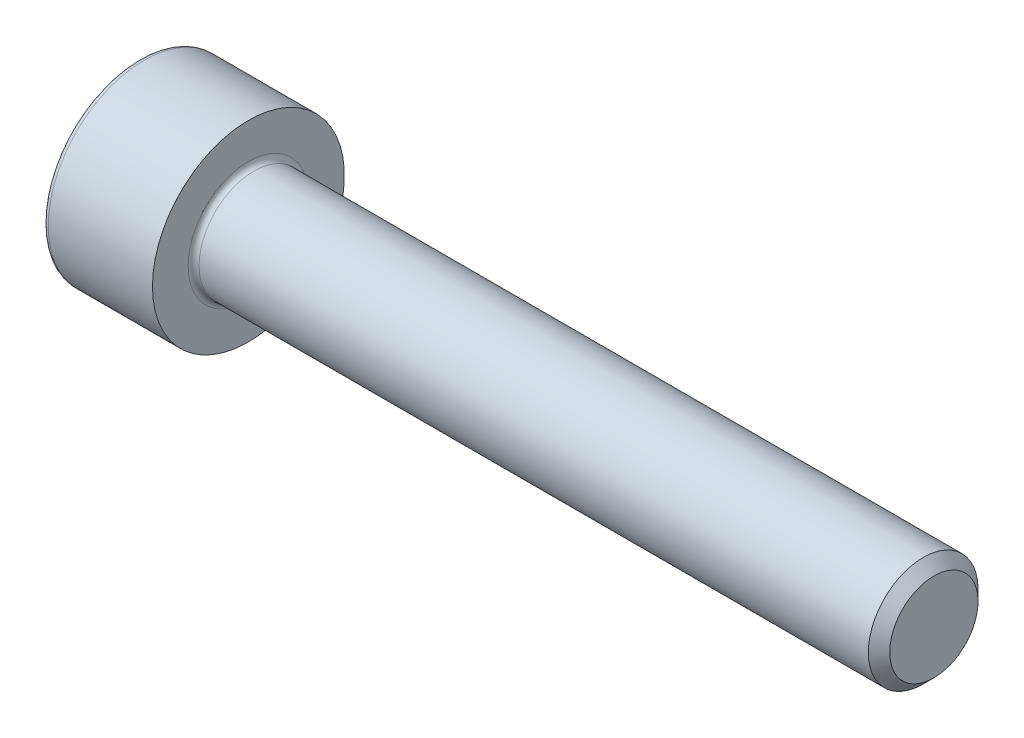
ISO-10303-21;
HEADER;
FILE_DESCRIPTION(('STEP AP214'),'2;1');
FILE_NAME('part.step','',(''),(''),'','','');
FILE_SCHEMA(('AUTOMOTIVE_DESIGN { 1 0 10303 214 1 1 1 1 }'));
ENDSEC;
DATA;
#1=APPLICATION_CONTEXT('core data for automotive mechanical design processes');
#2=APPLICATION_PROTOCOL_DEFINITION('international standard','automotive_design',2000,#1);
#3=PRODUCT_CONTEXT('',#1,'mechanical');
#4=PRODUCT('Part','Part','',(#3));
#5=PRODUCT_RELATED_PRODUCT_CATEGORY('part','',(#4));
#6=PRODUCT_DEFINITION_FORMATION('','',#4);
#7=PRODUCT_DEFINITION_CONTEXT('part definition',#1,'design');
#8=PRODUCT_DEFINITION('design','',#6,#7);
#9=PRODUCT_DEFINITION_SHAPE('','',#8);
#10=(LENGTH_UNIT() NAMED_UNIT(*) SI_UNIT(.MILLI.,.METRE.));
#11=(NAMED_UNIT(*) PLANE_ANGLE_UNIT() SI_UNIT($,.RADIAN.));
#12=(NAMED_UNIT(*) SI_UNIT($,.STERADIAN.) SOLID_ANGLE_UNIT());
#13=UNCERTAINTY_MEASURE_WITH_UNIT(LENGTH_MEASURE(1.E-05),#10,'distance_accuracy_value','');
#14=(GEOMETRIC_REPRESENTATION_CONTEXT(3) GLOBAL_UNCERTAINTY_ASSIGNED_CONTEXT((#13)) GLOBAL_UNIT_ASSIGNED_CONTEXT((#10,
#11,#12)) REPRESENTATION_CONTEXT('',''));
#15=CARTESIAN_POINT('',(0.,0.,0.));
#16=DIRECTION('',(0.,0.,1.));
#17=DIRECTION('',(1.,0.,0.));
#18=AXIS2_PLACEMENT_3D('',#15,#16,#17);
#19=CARTESIAN_POINT('',(2.00000000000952,0.,0.));
#20=DIRECTION('',(-1.,0.,0.));
#21=DIRECTION('',(0.,0.,1.));
#22=AXIS2_PLACEMENT_3D('',#19,#20,#21);
#23=CONICAL_SURFACE('',#22,1.53549999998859,1.04719755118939);
#24=CARTESIAN_POINT('',(2.88652133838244,0.,1.13464793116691E-10));
#25=VERTEX_POINT('',#24);
#26=VERTEX_LOOP('',#25);
#27=FACE_BOUND('',#26,.T.);
#28=CARTESIAN_POINT('',(2.00000000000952,0.,0.));
#29=DIRECTION('',(-1.,0.,0.));
#30=DIRECTION('',(0.,0.,1.));
#31=AXIS2_PLACEMENT_3D('',#28,#29,#30);
#32=CIRCLE('',#31,1.53549999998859);
#33=CARTESIAN_POINT('',(2.00000000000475,0.,1.53549999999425));
#34=VERTEX_POINT('',#33);
#35=CARTESIAN_POINT('',(2.00000000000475,-1.32978200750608,0.767749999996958));
#36=VERTEX_POINT('',#35);
#37=EDGE_CURVE('E109',#34,#36,#32,.F.);
#38=ORIENTED_EDGE('',*,*,#37,.F.);
#39=CARTESIAN_POINT('',(2.00000000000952,0.,0.));
#40=DIRECTION('',(-1.,0.,0.));
#41=DIRECTION('',(0.,0.,1.));
#42=AXIS2_PLACEMENT_3D('',#39,#40,#41);
#43=CIRCLE('',#42,1.53549999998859);
#44=CARTESIAN_POINT('',(2.00000000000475,1.329782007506,0.767749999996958));
#45=VERTEX_POINT('',#44);
#46=EDGE_CURVE('E112',#34,#45,#43,.T.);
#47=ORIENTED_EDGE('',*,*,#46,.T.);
#48=CARTESIAN_POINT('',(2.00000000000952,0.,0.));
#49=DIRECTION('',(-1.,0.,0.));
#50=DIRECTION('',(0.,0.,1.));
#51=AXIS2_PLACEMENT_3D('',#48,#49,#50);
#52=CIRCLE('',#51,1.53549999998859);
#53=CARTESIAN_POINT('',(2.00000000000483,1.32978200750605,-0.76774999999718));
#54=VERTEX_POINT('',#53);
#55=EDGE_CURVE('E134',#45,#54,#52,.T.);
#56=ORIENTED_EDGE('',*,*,#55,.T.);
#57=CARTESIAN_POINT('',(2.00000000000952,0.,0.));
#58=DIRECTION('',(-1.,0.,0.));
#59=DIRECTION('',(0.,0.,1.));
#60=AXIS2_PLACEMENT_3D('',#57,#58,#59);
#61=CIRCLE('',#60,1.53549999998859);
#62=CARTESIAN_POINT('',(2.00000000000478,0.,-1.53549999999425));
#63=VERTEX_POINT('',#62);
#64=EDGE_CURVE('E164',#54,#63,#61,.T.);
#65=ORIENTED_EDGE('',*,*,#64,.T.);
#66=CARTESIAN_POINT('',(2.00000000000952,0.,0.));
#67=DIRECTION('',(-1.,0.,0.));
#68=DIRECTION('',(0.,0.,1.));
#69=AXIS2_PLACEMENT_3D('',#66,#67,#68);
#70=CIRCLE('',#69,1.53549999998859);
#71=CARTESIAN_POINT('',(2.00000000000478,-1.32978200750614,-0.76774999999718));
#72=VERTEX_POINT('',#71);
#73=EDGE_CURVE('E135',#72,#63,#70,.F.);
#74=ORIENTED_EDGE('',*,*,#73,.F.);
#75=CARTESIAN_POINT('',(2.00000000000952,0.,0.));
#76=DIRECTION('',(-1.,0.,0.));
#77=DIRECTION('',(0.,0.,1.));
#78=AXIS2_PLACEMENT_3D('',#75,#76,#77);
#79=CIRCLE('',#78,1.53549999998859);
#80=EDGE_CURVE('E115',#36,#72,#79,.F.);
#81=ORIENTED_EDGE('',*,*,#80,.F.);
#82=EDGE_LOOP('',(#38,#47,#56,#65,#74,#81));
#83=FACE_BOUND('',#82,.T.);
#84=ADVANCED_FACE('F24',(#27,#83),#23,.F.);
#85=CARTESIAN_POINT('',(1.99999999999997,1.77304267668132,-2.22044604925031E-13));
#86=DIRECTION('',(1.,0.,0.));
#87=DIRECTION('',(0.,0.,-1.));
#88=AXIS2_PLACEMENT_3D('',#85,#86,#87);
#89=PLANE('',#88);
#90=DIRECTION('',(0.,0.499999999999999,-0.866025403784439));
#91=VECTOR('',#90,1.);
#92=CARTESIAN_POINT('',(1.99999999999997,1.77304267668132,-2.22044604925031E-13));
#93=LINE('',#92,#91);
#94=CARTESIAN_POINT('',(2.00000000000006,0.886521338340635,1.53549999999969));
#95=VERTEX_POINT('',#94);
#96=EDGE_CURVE('E127',#45,#95,#93,.F.);
#97=ORIENTED_EDGE('',*,*,#96,.F.);
#98=ORIENTED_EDGE('',*,*,#46,.F.);
#99=DIRECTION('',(0.,-1.,0.));
#100=VECTOR('',#99,1.);
#101=CARTESIAN_POINT('',(2.00000000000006,-0.88652133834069,1.53549999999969));
#102=LINE('',#101,#100);
#103=EDGE_CURVE('E126',#34,#95,#102,.F.);
#104=ORIENTED_EDGE('',*,*,#103,.T.);
#105=EDGE_LOOP('',(#97,#98,#104));
#106=FACE_BOUND('',#105,.T.);
#107=ADVANCED_FACE('F131',(#106),#89,.F.);
#108=CARTESIAN_POINT('',(1.99999999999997,1.77304267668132,-2.22044604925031E-13));
#109=DIRECTION('',(1.,0.,0.));
#110=DIRECTION('',(0.,0.,-1.));
#111=AXIS2_PLACEMENT_3D('',#108,#109,#110);
#112=PLANE('',#111);
#113=DIRECTION('',(0.,-1.,0.));
#114=VECTOR('',#113,1.);
#115=CARTESIAN_POINT('',(2.00000000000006,-0.88652133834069,1.53549999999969));
#116=LINE('',#115,#114);
#117=CARTESIAN_POINT('',(2.00000000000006,-0.88652133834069,1.53549999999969));
#118=VERTEX_POINT('',#117);
#119=EDGE_CURVE('E120',#118,#34,#116,.F.);
#120=ORIENTED_EDGE('',*,*,#119,.T.);
#121=ORIENTED_EDGE('',*,*,#37,.T.);
#122=DIRECTION('',(0.,0.500000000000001,0.866025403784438));
#123=VECTOR('',#122,1.);
#124=CARTESIAN_POINT('',(2.00000000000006,-0.88652133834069,1.53549999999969));
#125=LINE('',#124,#123);
#126=EDGE_CURVE('E122',#118,#36,#125,.F.);
#127=ORIENTED_EDGE('',*,*,#126,.F.);
#128=EDGE_LOOP('',(#120,#121,#127));
#129=FACE_BOUND('',#128,.T.);
#130=ADVANCED_FACE('F121',(#129),#112,.F.);
#131=CARTESIAN_POINT('',(1.99999999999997,1.77304267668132,-2.22044604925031E-13));
#132=DIRECTION('',(1.,0.,0.));
#133=DIRECTION('',(0.,0.,-1.));
#134=AXIS2_PLACEMENT_3D('',#131,#132,#133);
#135=PLANE('',#134);
#136=DIRECTION('',(0.,0.500000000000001,0.866025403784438));
#137=VECTOR('',#136,1.);
#138=CARTESIAN_POINT('',(2.00000000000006,-0.88652133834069,1.53549999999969));
#139=LINE('',#138,#137);
#140=CARTESIAN_POINT('',(1.99999999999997,-1.77304267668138,-2.22044604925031E-13));
#141=VERTEX_POINT('',#140);
#142=EDGE_CURVE('E313',#36,#141,#139,.F.);
#143=ORIENTED_EDGE('',*,*,#142,.F.);
#144=ORIENTED_EDGE('',*,*,#80,.T.);
#145=DIRECTION('',(0.,-0.499999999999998,0.866025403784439));
#146=VECTOR('',#145,1.);
#147=CARTESIAN_POINT('',(1.99999999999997,-1.77304267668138,-2.22044604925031E-13));
#148=LINE('',#147,#146);
#149=EDGE_CURVE('E300',#141,#72,#148,.F.);
#150=ORIENTED_EDGE('',*,*,#149,.F.);
#151=EDGE_LOOP('',(#143,#144,#150));
#152=FACE_BOUND('',#151,.T.);
#153=ADVANCED_FACE('F490',(#152),#135,.F.);
#154=CARTESIAN_POINT('',(1.99999999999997,1.77304267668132,-2.22044604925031E-13));
#155=DIRECTION('',(1.,0.,0.));
#156=DIRECTION('',(0.,0.,-1.));
#157=AXIS2_PLACEMENT_3D('',#154,#155,#156);
#158=PLANE('',#157);
#159=DIRECTION('',(0.,-0.499999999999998,0.866025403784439));
#160=VECTOR('',#159,1.);
#161=CARTESIAN_POINT('',(1.99999999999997,-1.77304267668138,-2.22044604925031E-13));
#162=LINE('',#161,#160);
#163=CARTESIAN_POINT('',(2.00000000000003,-0.886521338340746,-1.53550000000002));
#164=VERTEX_POINT('',#163);
#165=EDGE_CURVE('E268',#72,#164,#162,.F.);
#166=ORIENTED_EDGE('',*,*,#165,.F.);
#167=ORIENTED_EDGE('',*,*,#73,.T.);
#168=DIRECTION('',(0.,1.,0.));
#169=VECTOR('',#168,1.);
#170=CARTESIAN_POINT('',(2.00000000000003,0.886521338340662,-1.53550000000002));
#171=LINE('',#170,#169);
#172=EDGE_CURVE('E267',#63,#164,#171,.F.);
#173=ORIENTED_EDGE('',*,*,#172,.T.);
#174=EDGE_LOOP('',(#166,#167,#173));
#175=FACE_BOUND('',#174,.T.);
#176=ADVANCED_FACE('F482',(#175),#158,.F.);
#177=CARTESIAN_POINT('',(1.99999999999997,1.77304267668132,-2.22044604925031E-13));
#178=DIRECTION('',(1.,0.,0.));
#179=DIRECTION('',(0.,0.,-1.));
#180=AXIS2_PLACEMENT_3D('',#177,#178,#179);
#181=PLANE('',#180);
#182=DIRECTION('',(0.,0.500000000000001,0.866025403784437));
#183=VECTOR('',#182,1.);
#184=CARTESIAN_POINT('',(1.99999999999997,1.77304267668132,-2.22044604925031E-13));
#185=LINE('',#184,#183);
#186=CARTESIAN_POINT('',(1.99999999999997,1.77304267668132,-2.22044604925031E-13));
#187=VERTEX_POINT('',#186);
#188=EDGE_CURVE('E248',#187,#54,#185,.F.);
#189=ORIENTED_EDGE('',*,*,#188,.T.);
#190=ORIENTED_EDGE('',*,*,#55,.F.);
#191=DIRECTION('',(0.,0.499999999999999,-0.866025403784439));
#192=VECTOR('',#191,1.);
#193=CARTESIAN_POINT('',(1.99999999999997,1.77304267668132,-2.22044604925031E-13));
#194=LINE('',#193,#192);
#195=EDGE_CURVE('E151',#187,#45,#194,.F.);
#196=ORIENTED_EDGE('',*,*,#195,.F.);
#197=EDGE_LOOP('',(#189,#190,#196));
#198=FACE_BOUND('',#197,.T.);
#199=ADVANCED_FACE('F474',(#198),#181,.F.);
#200=CARTESIAN_POINT('',(1.99999999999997,1.77304267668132,-2.22044604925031E-13));
#201=DIRECTION('',(1.,0.,0.));
#202=DIRECTION('',(0.,0.,-1.));
#203=AXIS2_PLACEMENT_3D('',#200,#201,#202);
#204=PLANE('',#203);
#205=DIRECTION('',(0.,1.,0.));
#206=VECTOR('',#205,1.);
#207=CARTESIAN_POINT('',(2.00000000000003,0.886521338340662,-1.53550000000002));
#208=LINE('',#207,#206);
#209=CARTESIAN_POINT('',(2.00000000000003,0.886521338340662,-1.53550000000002));
#210=VERTEX_POINT('',#209);
#211=EDGE_CURVE('E264',#210,#63,#208,.F.);
#212=ORIENTED_EDGE('',*,*,#211,.T.);
#213=ORIENTED_EDGE('',*,*,#64,.F.);
#214=DIRECTION('',(0.,0.500000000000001,0.866025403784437));
#215=VECTOR('',#214,1.);
#216=CARTESIAN_POINT('',(1.99999999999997,1.77304267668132,-2.22044604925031E-13));
#217=LINE('',#216,#215);
#218=EDGE_CURVE('E256',#54,#210,#217,.F.);
#219=ORIENTED_EDGE('',*,*,#218,.T.);
#220=EDGE_LOOP('',(#212,#213,#219));
#221=FACE_BOUND('',#220,.T.);
#222=ADVANCED_FACE('F466',(#221),#204,.F.);
#223=CARTESIAN_POINT('',(1.99999999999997,1.77304267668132,-2.22044604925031E-13));
#224=DIRECTION('',(0.,-0.866025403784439,-0.499999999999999));
#225=DIRECTION('',(0.,0.499999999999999,-0.866025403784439));
#226=AXIS2_PLACEMENT_3D('',#223,#224,#225);
#227=PLANE('',#226);
#228=ORIENTED_EDGE('',*,*,#96,.T.);
#229=DIRECTION('',(1.,0.,0.));
#230=VECTOR('',#229,1.);
#231=CARTESIAN_POINT('',(2.00000000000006,0.886521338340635,1.53549999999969));
#232=LINE('',#231,#230);
#233=CARTESIAN_POINT('',(0.,0.88652133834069,1.5354999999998));
#234=VERTEX_POINT('',#233);
#235=EDGE_CURVE('E140',#95,#234,#232,.F.);
#236=ORIENTED_EDGE('',*,*,#235,.T.);
#237=DIRECTION('',(0.,-0.499999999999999,0.866025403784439));
#238=VECTOR('',#237,1.);
#239=CARTESIAN_POINT('',(0.,1.77304267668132,0.));
#240=LINE('',#239,#238);
#241=CARTESIAN_POINT('',(0.,1.77304267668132,0.));
#242=VERTEX_POINT('',#241);
#243=EDGE_CURVE('E272',#242,#234,#240,.T.);
#244=ORIENTED_EDGE('',*,*,#243,.F.);
#245=DIRECTION('',(1.,0.,0.));
#246=VECTOR('',#245,1.);
#247=CARTESIAN_POINT('',(1.99999999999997,1.77304267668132,-2.22044604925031E-13));
#248=LINE('',#247,#246);
#249=EDGE_CURVE('E257',#242,#187,#248,.T.);
#250=ORIENTED_EDGE('',*,*,#249,.T.);
#251=ORIENTED_EDGE('',*,*,#195,.T.);
#252=EDGE_LOOP('',(#228,#236,#244,#250,#251));
#253=FACE_BOUND('',#252,.T.);
#254=ADVANCED_FACE('F459',(#253),#227,.T.);
#255=CARTESIAN_POINT('',(2.00000000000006,-0.88652133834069,1.53549999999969));
#256=DIRECTION('',(0.,0.,1.));
#257=DIRECTION('',(0.,-1.,0.));
#258=AXIS2_PLACEMENT_3D('',#255,#256,#257);
#259=PLANE('',#258);
#260=ORIENTED_EDGE('',*,*,#235,.F.);
#261=ORIENTED_EDGE('',*,*,#103,.F.);
#262=ORIENTED_EDGE('',*,*,#119,.F.);
#263=DIRECTION('',(1.,0.,0.));
#264=VECTOR('',#263,1.);
#265=CARTESIAN_POINT('',(2.00000000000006,-0.88652133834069,1.53549999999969));
#266=LINE('',#265,#264);
#267=CARTESIAN_POINT('',(0.,-0.886521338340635,1.5354999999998));
#268=VERTEX_POINT('',#267);
#269=EDGE_CURVE('E142',#268,#118,#266,.T.);
#270=ORIENTED_EDGE('',*,*,#269,.F.);
#271=DIRECTION('',(0.,1.,0.));
#272=VECTOR('',#271,1.);
#273=CARTESIAN_POINT('',(0.,0.,1.5354999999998));
#274=LINE('',#273,#272);
#275=EDGE_CURVE('E285',#234,#268,#274,.F.);
#276=ORIENTED_EDGE('',*,*,#275,.F.);
#277=EDGE_LOOP('',(#260,#261,#262,#270,#276));
#278=FACE_BOUND('',#277,.T.);
#279=ADVANCED_FACE('F138',(#278),#259,.F.);
#280=CARTESIAN_POINT('',(2.00000000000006,-0.88652133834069,1.53549999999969));
#281=DIRECTION('',(0.,0.866025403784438,-0.500000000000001));
#282=DIRECTION('',(0.,0.500000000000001,0.866025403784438));
#283=AXIS2_PLACEMENT_3D('',#280,#281,#282);
#284=PLANE('',#283);
#285=ORIENTED_EDGE('',*,*,#142,.T.);
#286=DIRECTION('',(1.,0.,0.));
#287=VECTOR('',#286,1.);
#288=CARTESIAN_POINT('',(1.99999999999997,-1.77304267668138,-2.22044604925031E-13));
#289=LINE('',#288,#287);
#290=CARTESIAN_POINT('',(0.,-1.77304267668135,0.));
#291=VERTEX_POINT('',#290);
#292=EDGE_CURVE('E308',#291,#141,#289,.T.);
#293=ORIENTED_EDGE('',*,*,#292,.F.);
#294=DIRECTION('',(0.,-0.500000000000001,-0.866025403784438));
#295=VECTOR('',#294,1.);
#296=CARTESIAN_POINT('',(0.,-0.886521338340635,1.5354999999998));
#297=LINE('',#296,#295);
#298=EDGE_CURVE('E322',#268,#291,#297,.T.);
#299=ORIENTED_EDGE('',*,*,#298,.F.);
#300=ORIENTED_EDGE('',*,*,#269,.T.);
#301=ORIENTED_EDGE('',*,*,#126,.T.);
#302=EDGE_LOOP('',(#285,#293,#299,#300,#301));
#303=FACE_BOUND('',#302,.T.);
#304=ADVANCED_FACE('F341',(#303),#284,.T.);
#305=CARTESIAN_POINT('',(1.99999999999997,-1.77304267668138,-2.22044604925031E-13));
#306=DIRECTION('',(0.,0.866025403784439,0.499999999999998));
#307=DIRECTION('',(0.,-0.499999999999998,0.866025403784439));
#308=AXIS2_PLACEMENT_3D('',#305,#306,#307);
#309=PLANE('',#308);
#310=ORIENTED_EDGE('',*,*,#165,.T.);
#311=DIRECTION('',(1.,0.,0.));
#312=VECTOR('',#311,1.);
#313=CARTESIAN_POINT('',(2.00000000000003,-0.886521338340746,-1.53550000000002));
#314=LINE('',#313,#312);
#315=CARTESIAN_POINT('',(0.,-0.886521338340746,-1.53550000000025));
#316=VERTEX_POINT('',#315);
#317=EDGE_CURVE('E277',#164,#316,#314,.F.);
#318=ORIENTED_EDGE('',*,*,#317,.T.);
#319=DIRECTION('',(0.,0.499999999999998,-0.866025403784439));
#320=VECTOR('',#319,1.);
#321=CARTESIAN_POINT('',(0.,-1.77304267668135,0.));
#322=LINE('',#321,#320);
#323=EDGE_CURVE('E319',#291,#316,#322,.T.);
#324=ORIENTED_EDGE('',*,*,#323,.F.);
#325=ORIENTED_EDGE('',*,*,#292,.T.);
#326=ORIENTED_EDGE('',*,*,#149,.T.);
#327=EDGE_LOOP('',(#310,#318,#324,#325,#326));
#328=FACE_BOUND('',#327,.T.);
#329=ADVANCED_FACE('F346',(#328),#309,.T.);
#330=CARTESIAN_POINT('',(2.00000000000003,0.886521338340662,-1.53550000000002));
#331=DIRECTION('',(0.,0.,-1.));
#332=DIRECTION('',(0.,1.,0.));
#333=AXIS2_PLACEMENT_3D('',#330,#331,#332);
#334=PLANE('',#333);
#335=ORIENTED_EDGE('',*,*,#317,.F.);
#336=ORIENTED_EDGE('',*,*,#172,.F.);
#337=ORIENTED_EDGE('',*,*,#211,.F.);
#338=DIRECTION('',(1.,0.,0.));
#339=VECTOR('',#338,1.);
#340=CARTESIAN_POINT('',(2.00000000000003,0.886521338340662,-1.53550000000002));
#341=LINE('',#340,#339);
#342=CARTESIAN_POINT('',(0.,0.886521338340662,-1.53550000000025));
#343=VERTEX_POINT('',#342);
#344=EDGE_CURVE('E261',#210,#343,#341,.F.);
#345=ORIENTED_EDGE('',*,*,#344,.T.);
#346=DIRECTION('',(0.,1.,0.));
#347=VECTOR('',#346,1.);
#348=CARTESIAN_POINT('',(0.,0.,-1.53550000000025));
#349=LINE('',#348,#347);
#350=EDGE_CURVE('E292',#316,#343,#349,.T.);
#351=ORIENTED_EDGE('',*,*,#350,.F.);
#352=EDGE_LOOP('',(#335,#336,#337,#345,#351));
#353=FACE_BOUND('',#352,.T.);
#354=ADVANCED_FACE('F434',(#353),#334,.F.);
#355=CARTESIAN_POINT('',(1.99999999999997,1.77304267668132,-2.22044604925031E-13));
#356=DIRECTION('',(0.,0.866025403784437,-0.500000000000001));
#357=DIRECTION('',(0.,0.500000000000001,0.866025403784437));
#358=AXIS2_PLACEMENT_3D('',#355,#356,#357);
#359=PLANE('',#358);
#360=ORIENTED_EDGE('',*,*,#344,.F.);
#361=ORIENTED_EDGE('',*,*,#218,.F.);
#362=ORIENTED_EDGE('',*,*,#188,.F.);
#363=ORIENTED_EDGE('',*,*,#249,.F.);
#364=DIRECTION('',(0.,0.500000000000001,0.866025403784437));
#365=VECTOR('',#364,1.);
#366=CARTESIAN_POINT('',(0.,0.886521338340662,-1.53550000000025));
#367=LINE('',#366,#365);
#368=EDGE_CURVE('E288',#343,#242,#367,.T.);
#369=ORIENTED_EDGE('',*,*,#368,.F.);
#370=EDGE_LOOP('',(#360,#361,#362,#363,#369));
#371=FACE_BOUND('',#370,.T.);
#372=ADVANCED_FACE('F428',(#371),#359,.F.);
#373=CARTESIAN_POINT('',(0.,0.,0.));
#374=DIRECTION('',(-1.,0.,0.));
#375=DIRECTION('',(0.,0.,1.));
#376=AXIS2_PLACEMENT_3D('',#373,#374,#375);
#377=PLANE('',#376);
#378=CARTESIAN_POINT('',(0.,0.,0.));
#379=DIRECTION('',(1.,0.,0.));
#380=DIRECTION('',(0.,0.,-1.));
#381=AXIS2_PLACEMENT_3D('',#378,#379,#380);
#382=CIRCLE('',#381,3.29999999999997);
#383=CARTESIAN_POINT('',(0.,0.,-3.29999999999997));
#384=VERTEX_POINT('',#383);
#385=CARTESIAN_POINT('',(0.,0.,3.29999999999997));
#386=VERTEX_POINT('',#385);
#387=EDGE_CURVE('E291',#384,#386,#382,.T.);
#388=ORIENTED_EDGE('',*,*,#387,.F.);
#389=CARTESIAN_POINT('',(0.,0.,0.));
#390=DIRECTION('',(1.,0.,0.));
#391=DIRECTION('',(0.,0.,1.));
#392=AXIS2_PLACEMENT_3D('',#389,#390,#391);
#393=CIRCLE('',#392,3.29999999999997);
#394=EDGE_CURVE('E363',#386,#384,#393,.T.);
#395=ORIENTED_EDGE('',*,*,#394,.F.);
#396=EDGE_LOOP('',(#388,#395));
#397=FACE_BOUND('',#396,.T.);
#398=ORIENTED_EDGE('',*,*,#350,.T.);
#399=ORIENTED_EDGE('',*,*,#368,.T.);
#400=ORIENTED_EDGE('',*,*,#243,.T.);
#401=ORIENTED_EDGE('',*,*,#275,.T.);
#402=ORIENTED_EDGE('',*,*,#298,.T.);
#403=ORIENTED_EDGE('',*,*,#323,.T.);
#404=EDGE_LOOP('',(#398,#399,#400,#401,#402,#403));
#405=FACE_BOUND('',#404,.T.);
#406=ADVANCED_FACE('F236',(#397,#405),#377,.T.);
#407=CARTESIAN_POINT('',(0.19999999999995,0.,0.));
#408=DIRECTION('',(-1.,0.,0.));
#409=DIRECTION('',(0.,0.,1.));
#410=AXIS2_PLACEMENT_3D('',#407,#408,#409);
#411=TOROIDAL_SURFACE('',#410,3.29999999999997,0.2);
#412=CARTESIAN_POINT('',(0.200000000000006,0.,0.));
#413=DIRECTION('',(-1.,0.,0.));
#414=DIRECTION('',(0.,0.,1.));
#415=AXIS2_PLACEMENT_3D('',#412,#413,#414);
#416=CIRCLE('',#415,3.5);
#417=CARTESIAN_POINT('',(0.199999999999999,0.,3.5));
#418=VERTEX_POINT('',#417);
#419=EDGE_CURVE('E163',#418,#418,#416,.F.);
#420=ORIENTED_EDGE('',*,*,#419,.F.);
#421=EDGE_LOOP('',(#420));
#422=FACE_BOUND('',#421,.T.);
#423=ORIENTED_EDGE('',*,*,#394,.T.);
#424=ORIENTED_EDGE('',*,*,#387,.T.);
#425=EDGE_LOOP('',(#423,#424));
#426=FACE_BOUND('',#425,.T.);
#427=ADVANCED_FACE('F231',(#422,#426),#411,.T.);
#428=CARTESIAN_POINT('',(-31.7499999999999,0.,0.));
#429=DIRECTION('',(-1.,0.,0.));
#430=DIRECTION('',(0.,0.,1.));
#431=AXIS2_PLACEMENT_3D('',#428,#429,#430);
#432=CYLINDRICAL_SURFACE('',#431,3.5);
#433=CARTESIAN_POINT('',(4.00000000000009,0.,-1.11022302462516E-13));
#434=DIRECTION('',(-1.,0.,0.));
#435=DIRECTION('',(0.,0.,1.));
#436=AXIS2_PLACEMENT_3D('',#433,#434,#435);
#437=CIRCLE('',#436,3.5);
#438=CARTESIAN_POINT('',(4.00000000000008,0.,3.5));
#439=VERTEX_POINT('',#438);
#440=EDGE_CURVE('E160',#439,#439,#437,.F.);
#441=CARTESIAN_POINT('',(4.00000000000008,0.,3.5));
#442=CARTESIAN_POINT('',(3.96041666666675,0.,3.5));
#443=CARTESIAN_POINT('',(3.92083333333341,0.,3.5));
#444=CARTESIAN_POINT('',(3.84166666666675,0.,3.5));
#445=CARTESIAN_POINT('',(3.80208333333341,0.,3.5));
#446=CARTESIAN_POINT('',(3.72291666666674,0.,3.5));
#447=CARTESIAN_POINT('',(3.68333333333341,0.,3.5));
#448=CARTESIAN_POINT('',(3.60416666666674,0.,3.5));
#449=CARTESIAN_POINT('',(3.5645833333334,0.,3.5));
#450=CARTESIAN_POINT('',(3.48541666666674,0.,3.5));
#451=CARTESIAN_POINT('',(3.4458333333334,0.,3.5));
#452=CARTESIAN_POINT('',(3.36666666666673,0.,3.5));
#453=CARTESIAN_POINT('',(3.3270833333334,0.,3.5));
#454=CARTESIAN_POINT('',(3.24791666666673,0.,3.5));
#455=CARTESIAN_POINT('',(3.20833333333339,0.,3.5));
#456=CARTESIAN_POINT('',(3.12916666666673,0.,3.5));
#457=CARTESIAN_POINT('',(3.08958333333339,0.,3.5));
#458=CARTESIAN_POINT('',(3.01041666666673,0.,3.5));
#459=CARTESIAN_POINT('',(2.97083333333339,0.,3.5));
#460=CARTESIAN_POINT('',(2.89166666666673,0.,3.5));
#461=CARTESIAN_POINT('',(2.85208333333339,0.,3.5));
#462=CARTESIAN_POINT('',(2.77291666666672,0.,3.5));
#463=CARTESIAN_POINT('',(2.73333333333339,0.,3.5));
#464=CARTESIAN_POINT('',(2.65416666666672,0.,3.5));
#465=CARTESIAN_POINT('',(2.61458333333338,0.,3.5));
#466=CARTESIAN_POINT('',(2.53541666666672,0.,3.5));
#467=CARTESIAN_POINT('',(2.49583333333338,0.,3.5));
#468=CARTESIAN_POINT('',(2.41666666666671,0.,3.5));
#469=CARTESIAN_POINT('',(2.37708333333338,0.,3.5));
#470=CARTESIAN_POINT('',(2.29791666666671,0.,3.5));
#471=CARTESIAN_POINT('',(2.25833333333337,0.,3.5));
#472=CARTESIAN_POINT('',(2.17916666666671,0.,3.5));
#473=CARTESIAN_POINT('',(2.13958333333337,0.,3.5));
#474=CARTESIAN_POINT('',(2.06041666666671,0.,3.5));
#475=CARTESIAN_POINT('',(2.02083333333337,0.,3.5));
#476=CARTESIAN_POINT('',(1.94166666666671,0.,3.5));
#477=CARTESIAN_POINT('',(1.90208333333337,0.,3.5));
#478=CARTESIAN_POINT('',(1.8229166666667,0.,3.5));
#479=CARTESIAN_POINT('',(1.78333333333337,0.,3.5));
#480=CARTESIAN_POINT('',(1.7041666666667,0.,3.5));
#481=CARTESIAN_POINT('',(1.66458333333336,0.,3.5));
#482=CARTESIAN_POINT('',(1.5854166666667,0.,3.5));
#483=CARTESIAN_POINT('',(1.54583333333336,0.,3.5));
#484=CARTESIAN_POINT('',(1.46666666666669,0.,3.5));
#485=CARTESIAN_POINT('',(1.42708333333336,0.,3.5));
#486=CARTESIAN_POINT('',(1.34791666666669,0.,3.5));
#487=CARTESIAN_POINT('',(1.30833333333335,0.,3.5));
#488=CARTESIAN_POINT('',(1.22916666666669,0.,3.5));
#489=CARTESIAN_POINT('',(1.18958333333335,0.,3.5));
#490=CARTESIAN_POINT('',(1.11041666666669,0.,3.5));
#491=CARTESIAN_POINT('',(1.07083333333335,0.,3.5));
#492=CARTESIAN_POINT('',(0.991666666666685,0.,3.5));
#493=CARTESIAN_POINT('',(0.952083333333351,0.,3.5));
#494=CARTESIAN_POINT('',(0.872916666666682,0.,3.5));
#495=CARTESIAN_POINT('',(0.833333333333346,0.,3.5));
#496=CARTESIAN_POINT('',(0.754166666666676,0.,3.5));
#497=CARTESIAN_POINT('',(0.714583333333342,0.,3.5));
#498=CARTESIAN_POINT('',(0.635416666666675,0.,3.5));
#499=CARTESIAN_POINT('',(0.595833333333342,0.,3.5));
#500=CARTESIAN_POINT('',(0.516666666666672,0.,3.5));
#501=CARTESIAN_POINT('',(0.477083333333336,0.,3.5));
#502=CARTESIAN_POINT('',(0.397916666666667,0.,3.5));
#503=CARTESIAN_POINT('',(0.358333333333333,0.,3.5));
#504=CARTESIAN_POINT('',(0.279166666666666,0.,3.5));
#505=CARTESIAN_POINT('',(0.239583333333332,0.,3.5));
#506=CARTESIAN_POINT('',(0.199999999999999,0.,3.5));
#507=B_SPLINE_CURVE_WITH_KNOTS('',3,(#441,#442,#443,#444,#445,#446,#447,#448,#449,#450,#451,
#452,#453,#454,#455,#456,#457,#458,#459,#460,#461,#462,#463,#464,#465,#466,#467,#468,#469,#470,
#471,#472,#473,#474,#475,#476,#477,#478,#479,#480,#481,#482,#483,#484,#485,#486,#487,#488,#489,
#490,#491,#492,#493,#494,#495,#496,#497,#498,#499,#500,#501,#502,#503,#504,#505,#506),
.UNSPECIFIED.,.F.,.F.,(4,2,2,2,2,2,2,2,2,2,2,2,2,2,2,2,2,2,2,2,2,2,2,2,2,2,2,2,2,2,2,2,4),(0.,
0.118750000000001,0.237500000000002,0.356250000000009,0.47500000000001,0.593750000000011,
0.712500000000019,0.831250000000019,0.95000000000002,1.06875000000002,1.18750000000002,
1.30625000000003,1.42500000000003,1.54375000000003,1.66250000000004,1.78125000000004,
1.90000000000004,2.01875000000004,2.13750000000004,2.25625000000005,2.37500000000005,
2.49375000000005,2.61250000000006,2.73125000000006,2.85000000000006,2.96875000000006,
3.08750000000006,3.20625000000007,3.32500000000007,3.44375000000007,3.56250000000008,
3.68125000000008,3.80000000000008),.UNSPECIFIED.);
#508=EDGE_CURVE('BSEAM235',#439,#418,#507,.T.);
#509=ORIENTED_EDGE('',*,*,#440,.F.);
#510=ORIENTED_EDGE('',*,*,#419,.T.);
#511=ORIENTED_EDGE('',*,*,#508,.T.);
#512=ORIENTED_EDGE('',*,*,#508,.F.);
#513=EDGE_LOOP('',(#509,#511,#510,#512));
#514=FACE_BOUND('',#513,.T.);
#515=ADVANCED_FACE('F235',(#514),#432,.T.);
#516=CARTESIAN_POINT('',(29.,1.61,0.));
#517=DIRECTION('',(1.,0.,0.));
#518=DIRECTION('',(0.,0.,-1.));
#519=AXIS2_PLACEMENT_3D('',#516,#517,#518);
#520=PLANE('',#519);
#521=CARTESIAN_POINT('',(28.9999999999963,0.,0.));
#522=DIRECTION('',(-1.,0.,0.));
#523=DIRECTION('',(0.,-1.,0.));
#524=AXIS2_PLACEMENT_3D('',#521,#522,#523);
#525=CIRCLE('',#524,1.61000000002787);
#526=CARTESIAN_POINT('',(28.9999999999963,-1.61000000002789,0.));
#527=VERTEX_POINT('',#526);
#528=EDGE_CURVE('E156',#527,#527,#525,.T.);
#529=ORIENTED_EDGE('',*,*,#528,.F.);
#530=EDGE_LOOP('',(#529));
#531=FACE_BOUND('',#530,.T.);
#532=ADVANCED_FACE('F208',(#531),#520,.T.);
#533=CARTESIAN_POINT('',(4.00000000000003,3.49999999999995,0.));
#534=DIRECTION('',(1.,0.,0.));
#535=DIRECTION('',(0.,0.,-1.));
#536=AXIS2_PLACEMENT_3D('',#533,#534,#535);
#537=PLANE('',#536);
#538=ORIENTED_EDGE('',*,*,#440,.T.);
#539=EDGE_LOOP('',(#538));
#540=FACE_BOUND('',#539,.T.);
#541=CARTESIAN_POINT('',(4.00000000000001,0.,0.));
#542=DIRECTION('',(1.,0.,0.));
#543=DIRECTION('',(0.,0.,1.));
#544=AXIS2_PLACEMENT_3D('',#541,#542,#543);
#545=CIRCLE('',#544,2.19999999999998);
#546=CARTESIAN_POINT('',(4.00000000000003,0.,-2.19999999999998));
#547=VERTEX_POINT('',#546);
#548=CARTESIAN_POINT('',(4.00000000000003,0.,2.19999999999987));
#549=VERTEX_POINT('',#548);
#550=EDGE_CURVE('E159',#547,#549,#545,.F.);
#551=ORIENTED_EDGE('',*,*,#550,.T.);
#552=CARTESIAN_POINT('',(4.00000000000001,0.,0.));
#553=DIRECTION('',(1.,0.,0.));
#554=DIRECTION('',(0.,0.,-1.));
#555=AXIS2_PLACEMENT_3D('',#552,#553,#554);
#556=CIRCLE('',#555,2.19999999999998);
#557=EDGE_CURVE('E43',#549,#547,#556,.F.);
#558=ORIENTED_EDGE('',*,*,#557,.T.);
#559=EDGE_LOOP('',(#551,#558));
#560=FACE_BOUND('',#559,.T.);
#561=ADVANCED_FACE('F199',(#540,#560),#537,.T.);
#562=CARTESIAN_POINT('',(28.6100000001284,0.,0.));
#563=DIRECTION('',(-1.,0.,0.));
#564=DIRECTION('',(0.,-1.,0.));
#565=AXIS2_PLACEMENT_3D('',#562,#563,#564);
#566=CONICAL_SURFACE('',#565,1.99999999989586,0.785398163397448);
#567=CARTESIAN_POINT('',(28.61,0.,0.));
#568=DIRECTION('',(-1.,0.,0.));
#569=DIRECTION('',(0.,0.,1.));
#570=AXIS2_PLACEMENT_3D('',#567,#568,#569);
#571=CIRCLE('',#570,1.99999999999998);
#572=CARTESIAN_POINT('',(28.61,-2.00000000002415,0.));
#573=VERTEX_POINT('',#572);
#574=EDGE_CURVE('E35',#573,#573,#571,.T.);
#575=CARTESIAN_POINT('',(28.61,-2.00000000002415,0.));
#576=CARTESIAN_POINT('',(28.6140625,-1.99593750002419,0.));
#577=CARTESIAN_POINT('',(28.6181249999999,-1.99187500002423,0.));
#578=CARTESIAN_POINT('',(28.6262499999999,-1.98375000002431,0.));
#579=CARTESIAN_POINT('',(28.6303124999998,-1.97968750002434,0.));
#580=CARTESIAN_POINT('',(28.6384374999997,-1.97156250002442,0.));
#581=CARTESIAN_POINT('',(28.6424999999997,-1.96750000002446,0.));
#582=CARTESIAN_POINT('',(28.6506249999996,-1.95937500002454,0.));
#583=CARTESIAN_POINT('',(28.6546874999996,-1.95531250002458,0.));
#584=CARTESIAN_POINT('',(28.6628124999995,-1.94718750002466,0.));
#585=CARTESIAN_POINT('',(28.6668749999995,-1.9431250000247,0.));
#586=CARTESIAN_POINT('',(28.6749999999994,-1.93500000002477,0.));
#587=CARTESIAN_POINT('',(28.6790624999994,-1.93093750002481,0.));
#588=CARTESIAN_POINT('',(28.6871874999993,-1.92281250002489,0.));
#589=CARTESIAN_POINT('',(28.6912499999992,-1.91875000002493,0.));
#590=CARTESIAN_POINT('',(28.6993749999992,-1.91062500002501,0.));
#591=CARTESIAN_POINT('',(28.7034374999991,-1.90656250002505,0.));
#592=CARTESIAN_POINT('',(28.711562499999,-1.89843750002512,0.));
#593=CARTESIAN_POINT('',(28.715624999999,-1.89437500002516,0.));
#594=CARTESIAN_POINT('',(28.7237499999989,-1.88625000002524,0.));
#595=CARTESIAN_POINT('',(28.7278124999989,-1.88218750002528,0.));
#596=CARTESIAN_POINT('',(28.7359374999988,-1.87406250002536,0.));
#597=CARTESIAN_POINT('',(28.7399999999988,-1.8700000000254,0.));
#598=CARTESIAN_POINT('',(28.7481249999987,-1.86187500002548,0.));
#599=CARTESIAN_POINT('',(28.7521874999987,-1.85781250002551,0.));
#600=CARTESIAN_POINT('',(28.7603124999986,-1.84968750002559,0.));
#601=CARTESIAN_POINT('',(28.7643749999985,-1.84562500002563,0.));
#602=CARTESIAN_POINT('',(28.7724999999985,-1.83750000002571,0.));
#603=CARTESIAN_POINT('',(28.7765624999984,-1.83343750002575,0.));
#604=CARTESIAN_POINT('',(28.7846874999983,-1.82531250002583,0.));
#605=CARTESIAN_POINT('',(28.7887499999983,-1.82125000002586,0.));
#606=CARTESIAN_POINT('',(28.7968749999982,-1.81312500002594,0.));
#607=CARTESIAN_POINT('',(28.8009374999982,-1.80906250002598,0.));
#608=CARTESIAN_POINT('',(28.8090624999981,-1.80093750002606,0.));
#609=CARTESIAN_POINT('',(28.8131249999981,-1.7968750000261,0.));
#610=CARTESIAN_POINT('',(28.821249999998,-1.78875000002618,0.));
#611=CARTESIAN_POINT('',(28.825312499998,-1.78468750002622,0.));
#612=CARTESIAN_POINT('',(28.8334374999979,-1.77656250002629,0.));
#613=CARTESIAN_POINT('',(28.8374999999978,-1.77250000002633,0.));
#614=CARTESIAN_POINT('',(28.8456249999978,-1.76437500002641,0.));
#615=CARTESIAN_POINT('',(28.8496874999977,-1.76031250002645,0.));
#616=CARTESIAN_POINT('',(28.8578124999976,-1.75218750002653,0.));
#617=CARTESIAN_POINT('',(28.8618749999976,-1.74812500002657,0.));
#618=CARTESIAN_POINT('',(28.8699999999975,-1.74000000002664,0.));
#619=CARTESIAN_POINT('',(28.8740624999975,-1.73593750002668,0.));
#620=CARTESIAN_POINT('',(28.8821874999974,-1.72781250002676,0.));
#621=CARTESIAN_POINT('',(28.8862499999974,-1.7237500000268,0.));
#622=CARTESIAN_POINT('',(28.8943749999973,-1.71562500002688,0.));
#623=CARTESIAN_POINT('',(28.8984374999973,-1.71156250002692,0.));
#624=CARTESIAN_POINT('',(28.9065624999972,-1.703437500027,0.));
#625=CARTESIAN_POINT('',(28.9106249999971,-1.69937500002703,0.));
#626=CARTESIAN_POINT('',(28.9187499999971,-1.69125000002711,0.));
#627=CARTESIAN_POINT('',(28.922812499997,-1.68718750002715,0.));
#628=CARTESIAN_POINT('',(28.9309374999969,-1.67906250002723,0.));
#629=CARTESIAN_POINT('',(28.9349999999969,-1.67500000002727,0.));
#630=CARTESIAN_POINT('',(28.9431249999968,-1.66687500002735,0.));
#631=CARTESIAN_POINT('',(28.9471874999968,-1.66281250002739,0.));
#632=CARTESIAN_POINT('',(28.9553124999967,-1.65468750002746,0.));
#633=CARTESIAN_POINT('',(28.9593749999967,-1.6506250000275,0.));
#634=CARTESIAN_POINT('',(28.9674999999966,-1.64250000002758,0.));
#635=CARTESIAN_POINT('',(28.9715624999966,-1.63843750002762,0.));
#636=CARTESIAN_POINT('',(28.9796874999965,-1.6303125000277,0.));
#637=CARTESIAN_POINT('',(28.9837499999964,-1.62625000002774,0.));
#638=CARTESIAN_POINT('',(28.9918749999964,-1.61812500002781,0.));
#639=CARTESIAN_POINT('',(28.9959374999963,-1.61406250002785,0.));
#640=CARTESIAN_POINT('',(28.9999999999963,-1.61000000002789,0.));
#641=B_SPLINE_CURVE_WITH_KNOTS('',3,(#575,#576,#577,#578,#579,#580,#581,#582,#583,#584,#585,
#586,#587,#588,#589,#590,#591,#592,#593,#594,#595,#596,#597,#598,#599,#600,#601,#602,#603,#604,
#605,#606,#607,#608,#609,#610,#611,#612,#613,#614,#615,#616,#617,#618,#619,#620,#621,#622,#623,
#624,#625,#626,#627,#628,#629,#630,#631,#632,#633,#634,#635,#636,#637,#638,#639,#640),
.UNSPECIFIED.,.F.,.F.,(4,2,2,2,2,2,2,2,2,2,2,2,2,2,2,2,2,2,2,2,2,2,2,2,2,2,2,2,2,2,2,2,4),(0.,
0.0172357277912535,0.0344714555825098,0.0517071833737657,0.0689429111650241,0.0861786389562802,
0.103414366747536,0.120650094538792,0.137885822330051,0.155121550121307,0.172357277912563,
0.189593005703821,0.206828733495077,0.224064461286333,0.241300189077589,0.258535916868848,
0.275771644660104,0.29300737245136,0.310243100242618,0.327478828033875,0.344714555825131,
0.361950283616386,0.379186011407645,0.396421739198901,0.413657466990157,0.430893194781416,
0.448128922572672,0.465364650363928,0.482600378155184,0.499836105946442,0.517071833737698,
0.534307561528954,0.551543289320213),.UNSPECIFIED.);
#642=EDGE_CURVE('BSEAM187',#573,#527,#641,.T.);
#643=ORIENTED_EDGE('',*,*,#574,.F.);
#644=ORIENTED_EDGE('',*,*,#528,.T.);
#645=ORIENTED_EDGE('',*,*,#642,.T.);
#646=ORIENTED_EDGE('',*,*,#642,.F.);
#647=EDGE_LOOP('',(#643,#645,#644,#646));
#648=FACE_BOUND('',#647,.T.);
#649=ADVANCED_FACE('F187',(#648),#566,.T.);
#650=CARTESIAN_POINT('',(4.20000000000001,0.,0.));
#651=DIRECTION('',(1.,0.,0.));
#652=DIRECTION('',(0.,0.,-1.));
#653=AXIS2_PLACEMENT_3D('',#650,#651,#652);
#654=TOROIDAL_SURFACE('',#653,2.19999999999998,0.2);
#655=CARTESIAN_POINT('',(4.19999999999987,0.,0.));
#656=DIRECTION('',(-1.,0.,0.));
#657=DIRECTION('',(0.,0.,1.));
#658=AXIS2_PLACEMENT_3D('',#655,#656,#657);
#659=CIRCLE('',#658,1.99999999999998);
#660=CARTESIAN_POINT('',(4.19999999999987,0.,1.99999999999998));
#661=VERTEX_POINT('',#660);
#662=EDGE_CURVE('E13',#661,#661,#659,.F.);
#663=ORIENTED_EDGE('',*,*,#662,.F.);
#664=EDGE_LOOP('',(#663));
#665=FACE_BOUND('',#664,.T.);
#666=ORIENTED_EDGE('',*,*,#550,.F.);
#667=ORIENTED_EDGE('',*,*,#557,.F.);
#668=EDGE_LOOP('',(#666,#667));
#669=FACE_BOUND('',#668,.T.);
#670=ADVANCED_FACE('F175',(#665,#669),#654,.F.);
#671=CARTESIAN_POINT('',(-31.7499999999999,0.,0.));
#672=DIRECTION('',(-1.,0.,0.));
#673=DIRECTION('',(0.,0.,1.));
#674=AXIS2_PLACEMENT_3D('',#671,#672,#673);
#675=CYLINDRICAL_SURFACE('',#674,1.99999999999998);
#676=ORIENTED_EDGE('',*,*,#662,.T.);
#677=EDGE_LOOP('',(#676));
#678=FACE_BOUND('',#677,.T.);
#679=ORIENTED_EDGE('',*,*,#574,.T.);
#680=EDGE_LOOP('',(#679));
#681=FACE_BOUND('',#680,.T.);
#682=ADVANCED_FACE('F186',(#678,#681),#675,.T.);
#683=CLOSED_SHELL('',(#84,#107,#130,#153,#176,#199,#222,#254,#279,#304,#329,#354,#372,#406,#427,
#515,#532,#561,#649,#670,#682));
#684=MANIFOLD_SOLID_BREP('B1',#683);
#685=ADVANCED_BREP_SHAPE_REPRESENTATION('',(#18,#684),#14);
#686=SHAPE_DEFINITION_REPRESENTATION(#9,#685);
ENDSEC;
END-ISO-10303-21;
